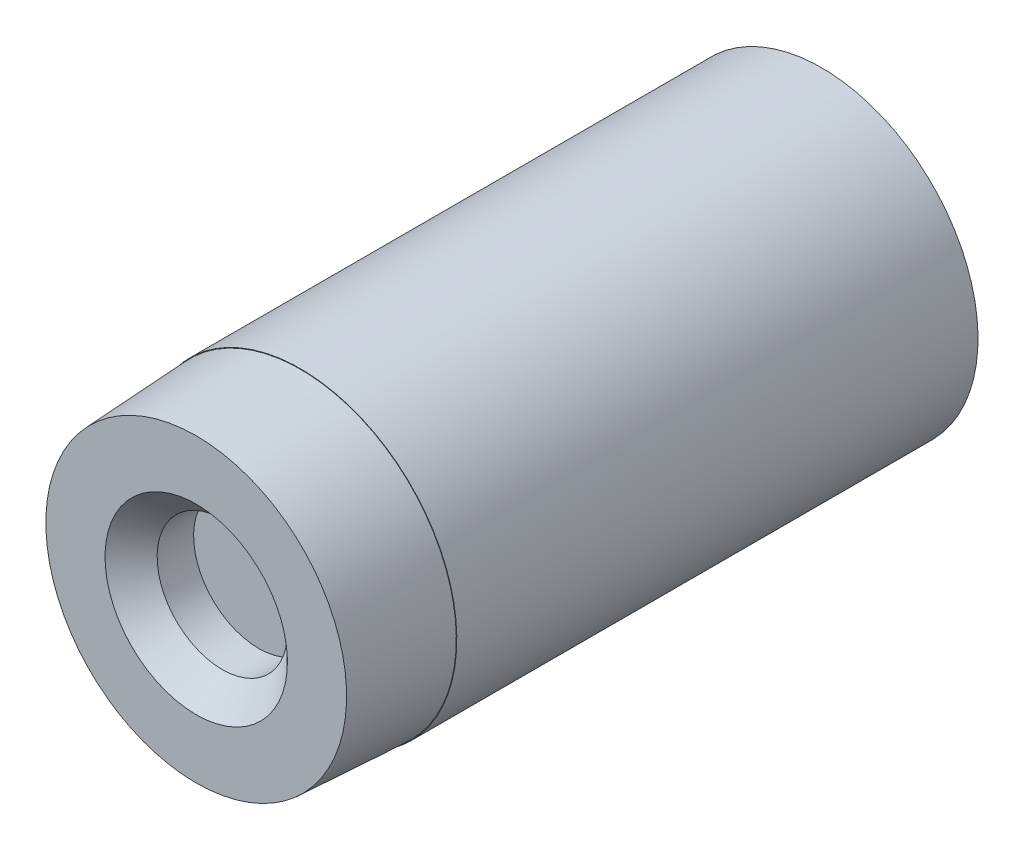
ISO-10303-21;
HEADER;
FILE_DESCRIPTION(('STEP AP214'),'2;1');
FILE_NAME('part.step','',(''),(''),'','','');
FILE_SCHEMA(('AUTOMOTIVE_DESIGN { 1 0 10303 214 1 1 1 1 }'));
ENDSEC;
DATA;
#1=APPLICATION_CONTEXT('core data for automotive mechanical design processes');
#2=APPLICATION_PROTOCOL_DEFINITION('international standard','automotive_design',2000,#1);
#3=PRODUCT_CONTEXT('',#1,'mechanical');
#4=PRODUCT('Part','Part','',(#3));
#5=PRODUCT_RELATED_PRODUCT_CATEGORY('part','',(#4));
#6=PRODUCT_DEFINITION_FORMATION('','',#4);
#7=PRODUCT_DEFINITION_CONTEXT('part definition',#1,'design');
#8=PRODUCT_DEFINITION('design','',#6,#7);
#9=PRODUCT_DEFINITION_SHAPE('','',#8);
#10=(LENGTH_UNIT() NAMED_UNIT(*) SI_UNIT(.MILLI.,.METRE.));
#11=(NAMED_UNIT(*) PLANE_ANGLE_UNIT() SI_UNIT($,.RADIAN.));
#12=(NAMED_UNIT(*) SI_UNIT($,.STERADIAN.) SOLID_ANGLE_UNIT());
#13=UNCERTAINTY_MEASURE_WITH_UNIT(LENGTH_MEASURE(1.E-05),#10,'distance_accuracy_value','');
#14=(GEOMETRIC_REPRESENTATION_CONTEXT(3) GLOBAL_UNCERTAINTY_ASSIGNED_CONTEXT((#13)) GLOBAL_UNIT_ASSIGNED_CONTEXT((#10,
#11,#12)) REPRESENTATION_CONTEXT('',''));
#15=CARTESIAN_POINT('',(0.,0.,0.));
#16=DIRECTION('',(0.,0.,1.));
#17=DIRECTION('',(1.,0.,0.));
#18=AXIS2_PLACEMENT_3D('',#15,#16,#17);
#19=CARTESIAN_POINT('',(0.,0.,0.));
#20=DIRECTION('',(0.,0.,1.));
#21=DIRECTION('',(0.,-1.,0.));
#22=AXIS2_PLACEMENT_3D('',#19,#20,#21);
#23=PLANE('',#22);
#24=CARTESIAN_POINT('',(0.,0.,0.));
#25=DIRECTION('',(0.,0.,1.));
#26=DIRECTION('',(0.,-1.,0.));
#27=AXIS2_PLACEMENT_3D('',#24,#25,#26);
#28=CIRCLE('',#27,3.);
#29=CARTESIAN_POINT('',(0.,-3.,0.));
#30=VERTEX_POINT('',#29);
#31=EDGE_CURVE('E10',#30,#30,#28,.T.);
#32=ORIENTED_EDGE('',*,*,#31,.F.);
#33=EDGE_LOOP('',(#32));
#34=FACE_BOUND('',#33,.T.);
#35=ADVANCED_FACE('F32',(#34),#23,.F.);
#36=CARTESIAN_POINT('',(0.,0.,12.));
#37=DIRECTION('',(0.,0.,1.));
#38=DIRECTION('',(0.,-1.,0.));
#39=AXIS2_PLACEMENT_3D('',#36,#37,#38);
#40=CYLINDRICAL_SURFACE('',#39,3.);
#41=CARTESIAN_POINT('',(0.,0.,10.));
#42=DIRECTION('',(0.,0.,1.));
#43=DIRECTION('',(0.,-1.,0.));
#44=AXIS2_PLACEMENT_3D('',#41,#42,#43);
#45=CIRCLE('',#44,3.);
#46=CARTESIAN_POINT('',(0.,-3.,10.));
#47=VERTEX_POINT('',#46);
#48=EDGE_CURVE('E38',#47,#47,#45,.T.);
#49=ORIENTED_EDGE('',*,*,#48,.F.);
#50=EDGE_LOOP('',(#49));
#51=FACE_BOUND('',#50,.T.);
#52=ORIENTED_EDGE('',*,*,#31,.T.);
#53=EDGE_LOOP('',(#52));
#54=FACE_BOUND('',#53,.T.);
#55=ADVANCED_FACE('F89',(#51,#54),#40,.T.);
#56=CARTESIAN_POINT('',(0.,2.99,10.));
#57=DIRECTION('',(0.,0.,-1.));
#58=DIRECTION('',(0.,1.,0.));
#59=AXIS2_PLACEMENT_3D('',#56,#57,#58);
#60=PLANE('',#59);
#61=CARTESIAN_POINT('',(0.,0.,10.));
#62=DIRECTION('',(0.,0.,1.));
#63=DIRECTION('',(0.,-1.,0.));
#64=AXIS2_PLACEMENT_3D('',#61,#62,#63);
#65=CIRCLE('',#64,2.99);
#66=CARTESIAN_POINT('',(0.,-2.99,10.));
#67=VERTEX_POINT('',#66);
#68=EDGE_CURVE('E42',#67,#67,#65,.T.);
#69=ORIENTED_EDGE('',*,*,#68,.F.);
#70=EDGE_LOOP('',(#69));
#71=FACE_BOUND('',#70,.T.);
#72=ORIENTED_EDGE('',*,*,#48,.T.);
#73=EDGE_LOOP('',(#72));
#74=FACE_BOUND('',#73,.T.);
#75=ADVANCED_FACE('F84',(#71,#74),#60,.F.);
#76=CARTESIAN_POINT('',(0.,0.,10.));
#77=DIRECTION('',(0.,0.,-1.));
#78=DIRECTION('',(0.,1.,0.));
#79=AXIS2_PLACEMENT_3D('',#76,#77,#78);
#80=CONICAL_SURFACE('',#79,2.99,0.0523598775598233);
#81=CARTESIAN_POINT('',(0.,0.,12.));
#82=DIRECTION('',(0.,0.,1.));
#83=DIRECTION('',(0.,-1.,0.));
#84=AXIS2_PLACEMENT_3D('',#81,#82,#83);
#85=CIRCLE('',#84,2.88518444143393);
#86=CARTESIAN_POINT('',(0.,-2.88518444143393,12.));
#87=VERTEX_POINT('',#86);
#88=EDGE_CURVE('E46',#87,#87,#85,.T.);
#89=ORIENTED_EDGE('',*,*,#88,.F.);
#90=EDGE_LOOP('',(#89));
#91=FACE_BOUND('',#90,.T.);
#92=ORIENTED_EDGE('',*,*,#68,.T.);
#93=EDGE_LOOP('',(#92));
#94=FACE_BOUND('',#93,.T.);
#95=ADVANCED_FACE('F78',(#91,#94),#80,.T.);
#96=CARTESIAN_POINT('',(0.,1.75,12.));
#97=DIRECTION('',(0.,0.,-1.));
#98=DIRECTION('',(0.,1.,0.));
#99=AXIS2_PLACEMENT_3D('',#96,#97,#98);
#100=PLANE('',#99);
#101=CARTESIAN_POINT('',(0.,0.,12.));
#102=DIRECTION('',(0.,0.,1.));
#103=DIRECTION('',(0.,-1.,0.));
#104=AXIS2_PLACEMENT_3D('',#101,#102,#103);
#105=CIRCLE('',#104,1.75);
#106=CARTESIAN_POINT('',(0.,-1.75,12.));
#107=VERTEX_POINT('',#106);
#108=EDGE_CURVE('E51',#107,#107,#105,.T.);
#109=ORIENTED_EDGE('',*,*,#108,.F.);
#110=EDGE_LOOP('',(#109));
#111=FACE_BOUND('',#110,.T.);
#112=ORIENTED_EDGE('',*,*,#88,.T.);
#113=EDGE_LOOP('',(#112));
#114=FACE_BOUND('',#113,.T.);
#115=ADVANCED_FACE('F72',(#111,#114),#100,.F.);
#116=CARTESIAN_POINT('',(0.,0.,12.));
#117=DIRECTION('',(0.,0.,1.));
#118=DIRECTION('',(0.,-1.,0.));
#119=AXIS2_PLACEMENT_3D('',#116,#117,#118);
#120=CONICAL_SURFACE('',#119,1.75,0.785398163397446);
#121=CARTESIAN_POINT('',(0.,0.,11.5));
#122=DIRECTION('',(0.,0.,1.));
#123=DIRECTION('',(0.,-1.,0.));
#124=AXIS2_PLACEMENT_3D('',#121,#122,#123);
#125=CIRCLE('',#124,1.25);
#126=CARTESIAN_POINT('',(0.,-1.25,11.5));
#127=VERTEX_POINT('',#126);
#128=EDGE_CURVE('E54',#127,#127,#125,.T.);
#129=ORIENTED_EDGE('',*,*,#128,.F.);
#130=EDGE_LOOP('',(#129));
#131=FACE_BOUND('',#130,.T.);
#132=ORIENTED_EDGE('',*,*,#108,.T.);
#133=EDGE_LOOP('',(#132));
#134=FACE_BOUND('',#133,.T.);
#135=ADVANCED_FACE('F66',(#131,#134),#120,.F.);
#136=CARTESIAN_POINT('',(0.,0.,12.));
#137=DIRECTION('',(0.,0.,1.));
#138=DIRECTION('',(0.,-1.,0.));
#139=AXIS2_PLACEMENT_3D('',#136,#137,#138);
#140=CYLINDRICAL_SURFACE('',#139,1.25);
#141=CARTESIAN_POINT('',(0.,0.,10.8));
#142=DIRECTION('',(0.,0.,1.));
#143=DIRECTION('',(0.,-1.,0.));
#144=AXIS2_PLACEMENT_3D('',#141,#142,#143);
#145=CIRCLE('',#144,1.25);
#146=CARTESIAN_POINT('',(0.,-1.25,10.8));
#147=VERTEX_POINT('',#146);
#148=EDGE_CURVE('E57',#147,#147,#145,.T.);
#149=ORIENTED_EDGE('',*,*,#148,.F.);
#150=EDGE_LOOP('',(#149));
#151=FACE_BOUND('',#150,.T.);
#152=ORIENTED_EDGE('',*,*,#128,.T.);
#153=EDGE_LOOP('',(#152));
#154=FACE_BOUND('',#153,.T.);
#155=ADVANCED_FACE('F63',(#151,#154),#140,.F.);
#156=CARTESIAN_POINT('',(0.,0.,10.8));
#157=DIRECTION('',(0.,0.,-1.));
#158=DIRECTION('',(0.,1.,0.));
#159=AXIS2_PLACEMENT_3D('',#156,#157,#158);
#160=PLANE('',#159);
#161=ORIENTED_EDGE('',*,*,#148,.T.);
#162=EDGE_LOOP('',(#161));
#163=FACE_BOUND('',#162,.T.);
#164=ADVANCED_FACE('F61',(#163),#160,.F.);
#165=CLOSED_SHELL('',(#35,#55,#75,#95,#115,#135,#155,#164));
#166=MANIFOLD_SOLID_BREP('B2',#165);
#167=ADVANCED_BREP_SHAPE_REPRESENTATION('',(#18,#166),#14);
#168=SHAPE_DEFINITION_REPRESENTATION(#9,#167);
ENDSEC;
END-ISO-10303-21;
